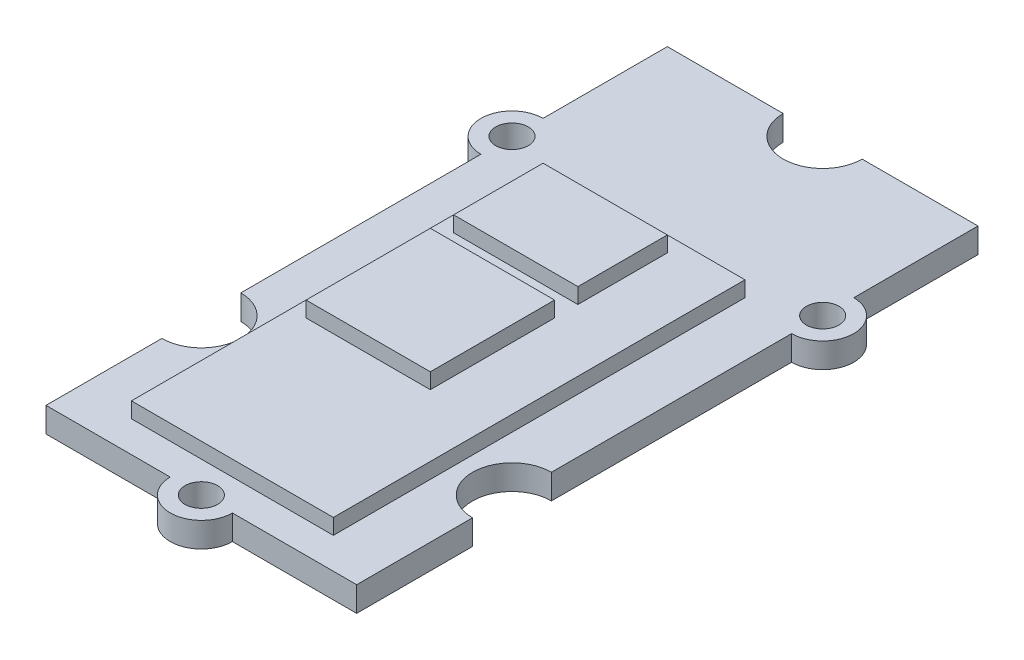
from build123d import *

# Parameters (mm, degrees)
ESQUISSE1_R        = 1.05
BOSS_EXTRU_1_DEPTH = 1.6
ESQUISSE2_W        = 13
ESQUISSE2_H        = 26.5
BOSS_EXTRU_2_DEPTH = 1
ESQUISSE3_W        = 8
ESQUISSE3_H        = 5.75839975
ESQUISSE3_H_2      = 8
BOSS_EXTRU_3_DEPTH = 1


with BuildPart() as part:
    # Esquisse1 → Boss.-Extru.1 (new body)
    with BuildSketch(Plane(origin=(0, 0, 0), x_dir=(1, 0, 0), z_dir=(0, 1, 0))):
        with BuildLine():
            Line((10, -2), (10, -17.46))
            ThreePointArc((10, -17.46), (7.46, -20), (10, -22.54))
            Line((10, -22.54), (10, -30))
            Line((10, -30), (2, -30))
            ThreePointArc((2, -30), (0, -32), (-2, -30))
            Line((-2, -30), (-10, -30))
            Line((-10, -30), (-10, -22.54))
            ThreePointArc((-10, -22.54), (-7.46, -20), (-10, -17.46))
            Line((-10, -17.46), (-10, -2))
            ThreePointArc((-10, -2), (-12, 0), (-10, 2))
            Line((-10, 2), (-10, 10))
            Line((-10, 10), (-2.54, 10))
            ThreePointArc((-2.54, 10), (0, 7.46), (2.54, 10))
            Line((2.54, 10), (10, 10))
            Line((10, 10), (10, 2))
            ThreePointArc((10, 2), (12, 0), (10, -2))
        make_face()
        with Locations(Location((10, 0, 0), (0, 0, 270))):
            Circle(ESQUISSE1_R, mode=Mode.SUBTRACT)
        with Locations(Location((-10, 0, 0), (0, 0, 90))):
            Circle(ESQUISSE1_R, mode=Mode.SUBTRACT)
        with Locations(Location((0, -30, 0), (0, 0, 270))):
            Circle(ESQUISSE1_R, mode=Mode.SUBTRACT)
    extrude(amount=BOSS_EXTRU_1_DEPTH)

    # Esquisse2 → Boss.-Extru.2 (add)
    with BuildSketch(Plane(origin=(0, 1.6, 0), x_dir=(1, 0, 0), z_dir=(0, 1, 0))):
        with Locations((0, -14.75)):
            Rectangle(ESQUISSE2_W, ESQUISSE2_H)
    extrude(amount=BOSS_EXTRU_2_DEPTH)

    # Esquisse3 → Boss.-Extru.3 (add)
    with BuildSketch(Plane(origin=(0, 2.6, 0), x_dir=(1, 0, 0), z_dir=(0, 1, 0))):
        with Locations((-1.5, -5.379199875)):
            Rectangle(ESQUISSE3_W, ESQUISSE3_H)
        with Locations((-1.5, -13.75839975)):
            Rectangle(ESQUISSE3_W, ESQUISSE3_H_2)
    extrude(amount=BOSS_EXTRU_3_DEPTH)


solid = part.part
